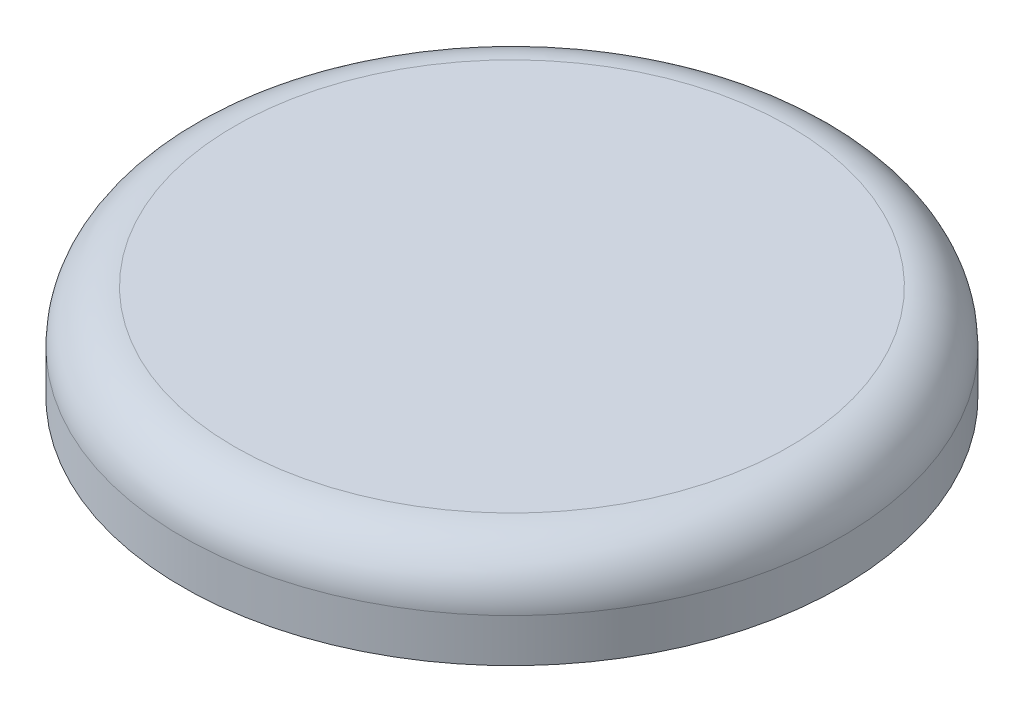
from build123d import *

# Parameters (mm, degrees)
CONG_1_R       = 3
CONG_2_R       = 1
ECHELLE1_SCALE = 1.018


with BuildPart() as part:
    # Esquisse1 → R_volution1 (revolve)
    with BuildSketch(Plane.XY, mode=Mode.PRIVATE) as r_volution1_sk:
        Polygon((0, 0), (-19, 0), (-19, -5.5), (-16.5, -5.5), (-16.193789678, -2), (-7.65, -2), (-7.222122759, -11.8), (-5.9, -11.8), (-5.557776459, -2), (0, -2), align=None)
    revolve(r_volution1_sk.sketch.rotate(Axis((0, 0, 0), (0, 1, 0)), 270), axis=Axis((0, 0, 0), (0, 1, 0)))

    # Cong_1
    cong_1_edges = [part.edges().sort_by_distance(p)[0] for p in [
        (0, 0, 19),
    ]]
    fillet(cong_1_edges, radius=CONG_1_R)

    # Cong_2
    cong_2_edges = [part.edges().sort_by_distance(p)[0] for p in [
        (0, -2, 16.193789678),
    ]]
    fillet(cong_2_edges, radius=CONG_2_R)

    # Esquisse2 → R_volution2 (revolve)
    with BuildSketch(Plane.XY, mode=Mode.PRIVATE) as r_volution2_sk:
        with BuildLine():
            Line((7.400604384, -7.712098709), (7.457644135, -6.405673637))
            ThreePointArc((7.457644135, -6.405673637), (7.578981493, -7.065429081), (7.400604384, -7.712098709))
        make_face()
    revolve(r_volution2_sk.sketch.rotate(Axis((0, 0.660903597, 0), (0, -1, 0)), 90), axis=Axis((0, 0.660903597, 0), (0, -1, 0)))


with BuildPart() as part_1:
    # Echelle1: scaled about (0, 0, 0)
    add(part.part.scale(ECHELLE1_SCALE))


solid = part_1.part
